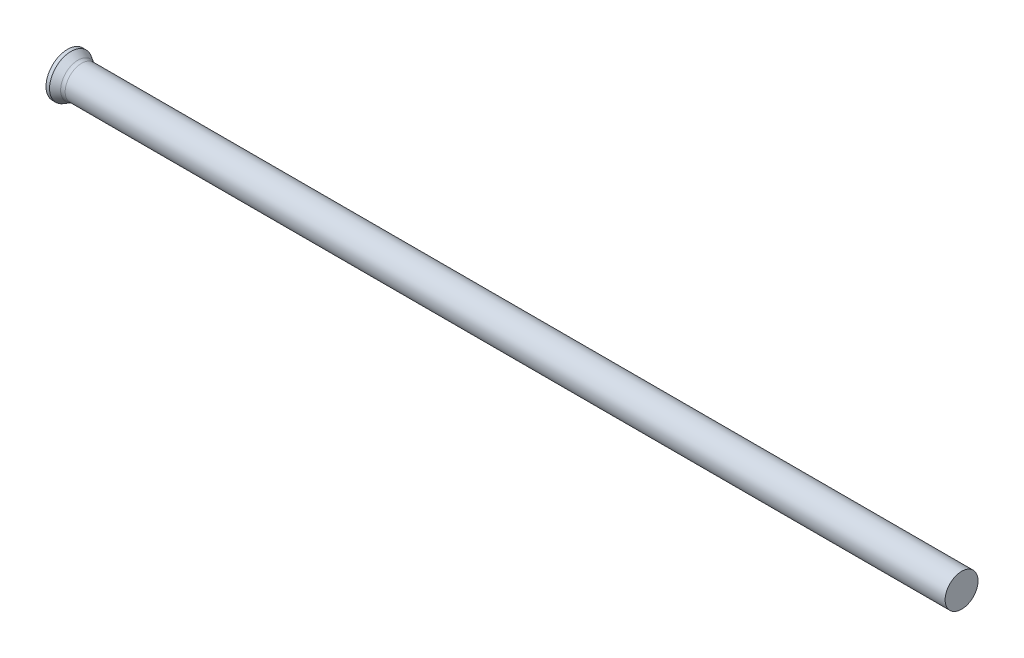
ISO-10303-21;
HEADER;
FILE_DESCRIPTION(('STEP AP214'),'2;1');
FILE_NAME('part.step','',(''),(''),'','','');
FILE_SCHEMA(('AUTOMOTIVE_DESIGN { 1 0 10303 214 1 1 1 1 }'));
ENDSEC;
DATA;
#1=APPLICATION_CONTEXT('core data for automotive mechanical design processes');
#2=APPLICATION_PROTOCOL_DEFINITION('international standard','automotive_design',2000,#1);
#3=PRODUCT_CONTEXT('',#1,'mechanical');
#4=PRODUCT('Part','Part','',(#3));
#5=PRODUCT_RELATED_PRODUCT_CATEGORY('part','',(#4));
#6=PRODUCT_DEFINITION_FORMATION('','',#4);
#7=PRODUCT_DEFINITION_CONTEXT('part definition',#1,'design');
#8=PRODUCT_DEFINITION('design','',#6,#7);
#9=PRODUCT_DEFINITION_SHAPE('','',#8);
#10=(LENGTH_UNIT() NAMED_UNIT(*) SI_UNIT(.MILLI.,.METRE.));
#11=(NAMED_UNIT(*) PLANE_ANGLE_UNIT() SI_UNIT($,.RADIAN.));
#12=(NAMED_UNIT(*) SI_UNIT($,.STERADIAN.) SOLID_ANGLE_UNIT());
#13=UNCERTAINTY_MEASURE_WITH_UNIT(LENGTH_MEASURE(1.E-05),#10,'distance_accuracy_value','');
#14=(GEOMETRIC_REPRESENTATION_CONTEXT(3) GLOBAL_UNCERTAINTY_ASSIGNED_CONTEXT((#13)) GLOBAL_UNIT_ASSIGNED_CONTEXT((#10,
#11,#12)) REPRESENTATION_CONTEXT('',''));
#15=CARTESIAN_POINT('',(0.,0.,0.));
#16=DIRECTION('',(0.,0.,1.));
#17=DIRECTION('',(1.,0.,0.));
#18=AXIS2_PLACEMENT_3D('',#15,#16,#17);
#19=CARTESIAN_POINT('',(0.,0.,0.));
#20=DIRECTION('',(1.,0.,0.));
#21=DIRECTION('',(0.,0.,-1.));
#22=AXIS2_PLACEMENT_3D('',#19,#20,#21);
#23=PLANE('',#22);
#24=CARTESIAN_POINT('',(0.,0.,0.));
#25=DIRECTION('',(-1.,0.,0.));
#26=DIRECTION('',(0.,0.,1.));
#27=AXIS2_PLACEMENT_3D('',#24,#25,#26);
#28=CIRCLE('',#27,3.);
#29=CARTESIAN_POINT('',(0.,0.,3.));
#30=VERTEX_POINT('',#29);
#31=EDGE_CURVE('E25',#30,#30,#28,.T.);
#32=ORIENTED_EDGE('',*,*,#31,.T.);
#33=EDGE_LOOP('',(#32));
#34=FACE_BOUND('',#33,.T.);
#35=ADVANCED_FACE('F14',(#34),#23,.F.);
#36=CARTESIAN_POINT('',(0.,0.,0.));
#37=DIRECTION('',(-1.,0.,0.));
#38=DIRECTION('',(0.,0.,1.));
#39=AXIS2_PLACEMENT_3D('',#36,#37,#38);
#40=CYLINDRICAL_SURFACE('',#39,3.);
#41=ORIENTED_EDGE('',*,*,#31,.F.);
#42=EDGE_LOOP('',(#41));
#43=FACE_BOUND('',#42,.T.);
#44=CARTESIAN_POINT('',(0.497564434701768,0.,0.));
#45=DIRECTION('',(-1.,0.,0.));
#46=DIRECTION('',(0.,0.,1.));
#47=AXIS2_PLACEMENT_3D('',#44,#45,#46);
#48=CIRCLE('',#47,3.);
#49=CARTESIAN_POINT('',(0.497564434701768,0.,3.));
#50=VERTEX_POINT('',#49);
#51=EDGE_CURVE('E29',#50,#50,#48,.T.);
#52=ORIENTED_EDGE('',*,*,#51,.T.);
#53=EDGE_LOOP('',(#52));
#54=FACE_BOUND('',#53,.T.);
#55=ADVANCED_FACE('F53',(#43,#54),#40,.T.);
#56=CARTESIAN_POINT('',(1.71,0.,0.));
#57=DIRECTION('',(-1.,0.,0.));
#58=DIRECTION('',(0.,0.,1.));
#59=AXIS2_PLACEMENT_3D('',#56,#57,#58);
#60=CONICAL_SURFACE('',#59,2.3,0.523598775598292);
#61=CARTESIAN_POINT('',(1.47794919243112,0.,0.));
#62=DIRECTION('',(-1.,0.,0.));
#63=DIRECTION('',(0.,0.,1.));
#64=AXIS2_PLACEMENT_3D('',#61,#62,#63);
#65=CIRCLE('',#64,2.43397459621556);
#66=CARTESIAN_POINT('',(1.47794919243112,0.,2.43397459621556));
#67=VERTEX_POINT('',#66);
#68=EDGE_CURVE('E21',#67,#67,#65,.T.);
#69=ORIENTED_EDGE('',*,*,#68,.T.);
#70=EDGE_LOOP('',(#69));
#71=FACE_BOUND('',#70,.T.);
#72=ORIENTED_EDGE('',*,*,#51,.F.);
#73=EDGE_LOOP('',(#72));
#74=FACE_BOUND('',#73,.T.);
#75=ADVANCED_FACE('F50',(#71,#74),#60,.T.);
#76=CARTESIAN_POINT('',(0.,0.,0.));
#77=DIRECTION('',(-1.,0.,0.));
#78=DIRECTION('',(0.,0.,1.));
#79=AXIS2_PLACEMENT_3D('',#76,#77,#78);
#80=CYLINDRICAL_SURFACE('',#79,2.3);
#81=CARTESIAN_POINT('',(1.97794919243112,0.,0.));
#82=DIRECTION('',(-1.,0.,0.));
#83=DIRECTION('',(0.,0.,1.));
#84=AXIS2_PLACEMENT_3D('',#81,#82,#83);
#85=CIRCLE('',#84,2.3);
#86=CARTESIAN_POINT('',(1.97794919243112,0.,2.3));
#87=VERTEX_POINT('',#86);
#88=EDGE_CURVE('E9',#87,#87,#85,.F.);
#89=ORIENTED_EDGE('',*,*,#88,.T.);
#90=EDGE_LOOP('',(#89));
#91=FACE_BOUND('',#90,.T.);
#92=CARTESIAN_POINT('',(125.,0.,0.));
#93=DIRECTION('',(-1.,0.,0.));
#94=DIRECTION('',(0.,0.,1.));
#95=AXIS2_PLACEMENT_3D('',#92,#93,#94);
#96=CIRCLE('',#95,2.3);
#97=CARTESIAN_POINT('',(125.,0.,2.3));
#98=VERTEX_POINT('',#97);
#99=EDGE_CURVE('E34',#98,#98,#96,.T.);
#100=ORIENTED_EDGE('',*,*,#99,.T.);
#101=EDGE_LOOP('',(#100));
#102=FACE_BOUND('',#101,.T.);
#103=ADVANCED_FACE('F38',(#91,#102),#80,.T.);
#104=CARTESIAN_POINT('',(125.,2.3,0.));
#105=DIRECTION('',(-1.,0.,0.));
#106=DIRECTION('',(0.,0.,1.));
#107=AXIS2_PLACEMENT_3D('',#104,#105,#106);
#108=PLANE('',#107);
#109=ORIENTED_EDGE('',*,*,#99,.F.);
#110=EDGE_LOOP('',(#109));
#111=FACE_BOUND('',#110,.T.);
#112=ADVANCED_FACE('F40',(#111),#108,.F.);
#113=CARTESIAN_POINT('',(1.97794919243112,0.,0.));
#114=DIRECTION('',(-1.,0.,0.));
#115=DIRECTION('',(0.,0.,1.));
#116=AXIS2_PLACEMENT_3D('',#113,#114,#115);
#117=TOROIDAL_SURFACE('',#116,3.3,1.);
#118=ORIENTED_EDGE('',*,*,#88,.F.);
#119=EDGE_LOOP('',(#118));
#120=FACE_BOUND('',#119,.T.);
#121=ORIENTED_EDGE('',*,*,#68,.F.);
#122=EDGE_LOOP('',(#121));
#123=FACE_BOUND('',#122,.T.);
#124=ADVANCED_FACE('F16',(#120,#123),#117,.F.);
#125=CLOSED_SHELL('',(#35,#55,#75,#103,#112,#124));
#126=MANIFOLD_SOLID_BREP('B1',#125);
#127=ADVANCED_BREP_SHAPE_REPRESENTATION('',(#18,#126),#14);
#128=SHAPE_DEFINITION_REPRESENTATION(#9,#127);
ENDSEC;
END-ISO-10303-21;
